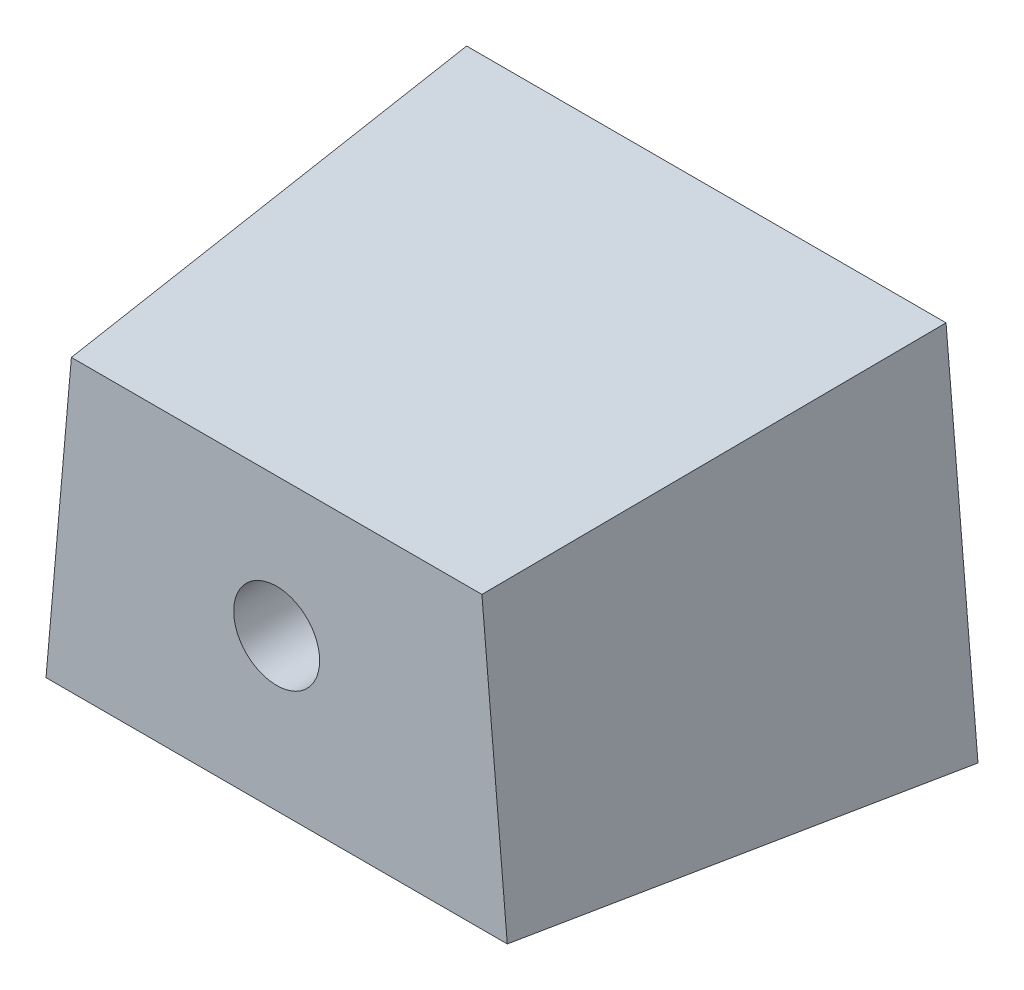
from build123d import *

# Parameters (mm, degrees)
Y_KSEKLIK_EKSTR_ZYON1_DEPTH = 40
Y_KSEKLIK_EKSTR_ZYON1_TAPER = 5
IZIM2_R                     = 4
KES_EKSTR_ZYON1_DEPTH       = 8
KES_EKSTR_ZYON2_DEPTH       = 50
KES_EKSTR_ZYON2_TAPER       = -5
KES_EKSTR_ZYON3_START       = -5
IZIM4_R                     = 4
KES_EKSTR_ZYON3_DEPTH       = 5


with BuildPart() as part:
    # izim1 → Y_kseklik-Ekstr_zyon1 (new body)
    with BuildSketch(Plane.XY):
        Polygon((-22, 20), (-25.5, -20.00518306), (25.5, -20.00518306), (22, 20), align=None)
    extrude(amount=Y_KSEKLIK_EKSTR_ZYON1_DEPTH, taper=Y_KSEKLIK_EKSTR_ZYON1_TAPER)

    # izim2 → Kes-Ekstr_zyon1 (cut)
    with BuildSketch(Plane.XY.offset(40)):
        Circle(IZIM2_R)
    extrude(amount=-KES_EKSTR_ZYON1_DEPTH, mode=Mode.SUBTRACT)

    # izim3 → Kes-Ekstr_zyon2 (cut)
    with BuildSketch(Plane(origin=(0, 0, 0), x_dir=(-1, 0, 0), z_dir=(0, 0, -1))):
        Polygon((22.315530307, 16.393472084), (22, 20), (-22, 20), (-22.315530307, 16.393472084), align=None)
        Polygon((25.290144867, -17.606527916), (-25.290144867, -17.606527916), (-25.5, -20.00518306), (25.5, -20.00518306), align=None)
    extrude(amount=-KES_EKSTR_ZYON2_DEPTH, taper=KES_EKSTR_ZYON2_TAPER, mode=Mode.SUBTRACT)

    # izim4 → Kes-Ekstr_zyon3 (cut)
    with BuildSketch(Plane(origin=(0, 0, 0), x_dir=(-1, 0, 0), z_dir=(0, 0, -1)).offset(KES_EKSTR_ZYON3_START)):
        with Locations(Location((0, 0, 0), (0, 0, 180))):
            Circle(IZIM4_R)
    extrude(amount=KES_EKSTR_ZYON3_DEPTH, mode=Mode.SUBTRACT)


solid = part.part
